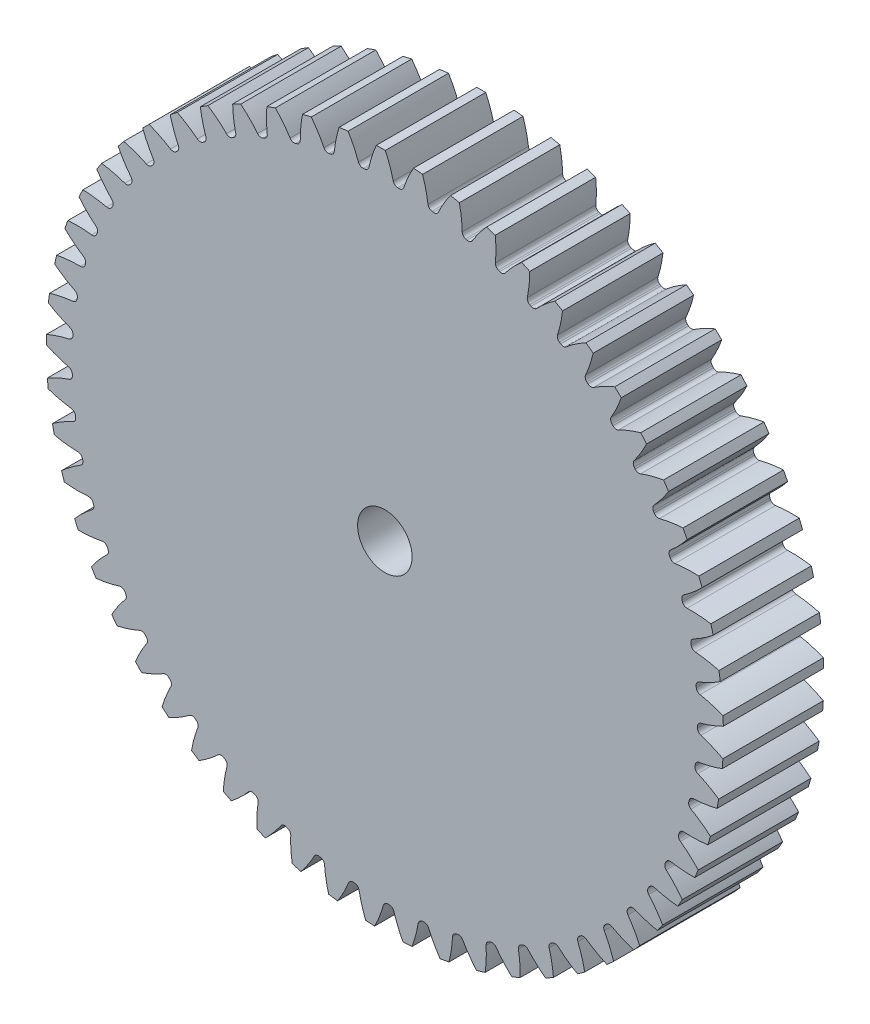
from build123d import *

# Parameters (mm, degrees)
SKETCH3_R         = 299.72
GEARBODY_DEPTH    = 88.9
TOOTHCUT_DEPTH    = 434.090483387
CIRPATTERN1_COUNT = 57
BOREDIA_R         = 24.13
BORE_DEPTH        = 12700


with BuildPart() as part:
    # Sketch3 → gearBody (new body)
    with BuildSketch(Plane.XY):
        Circle(SKETCH3_R)
    extrude(amount=GEARBODY_DEPTH)

    # Sketch2 → toothCut (cut, through all)
    with BuildSketch(Plane.XY):
        with BuildLine():
            ThreePointArc((276.814850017, -4.999841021), (276.826118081, -4.331275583), (276.835771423, -3.662684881))
            ThreePointArc((276.835771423, -3.662684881), (277.699107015, -1.18815843), (279.876548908, 0.270394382))
            ThreePointArc((279.876548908, 0.270394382), (289.986703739, 3.589062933), (299.72, 7.889264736))
            ThreePointArc((299.72, 7.889264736), (299.787120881, -4.690527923), (299.326477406, -17.262063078))
            ThreePointArc((299.326477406, -17.262063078), (289.732476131, -12.659462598), (279.731093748, -9.026125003))
            ThreePointArc((279.731093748, -9.026125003), (277.600348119, -7.500165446), (276.814850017, -4.999841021))
        make_face()
    toothcut = extrude(amount=TOOTHCUT_DEPTH, mode=Mode.SUBTRACT)

    # CirPattern1: toothCut ×57 about axis
    cirpattern1_axis = Axis((0, 0, 0), (0, 0, 1))
    for i in range(1, CIRPATTERN1_COUNT):
        add(toothcut.rotate(cirpattern1_axis, i * 360 / CIRPATTERN1_COUNT), mode=Mode.SUBTRACT)

    # boreDia → bore (cut, symmetric)
    with BuildSketch(Plane.XY):
        Circle(BOREDIA_R)
    extrude(amount=BORE_DEPTH, both=True, mode=Mode.SUBTRACT)


solid = part.part
